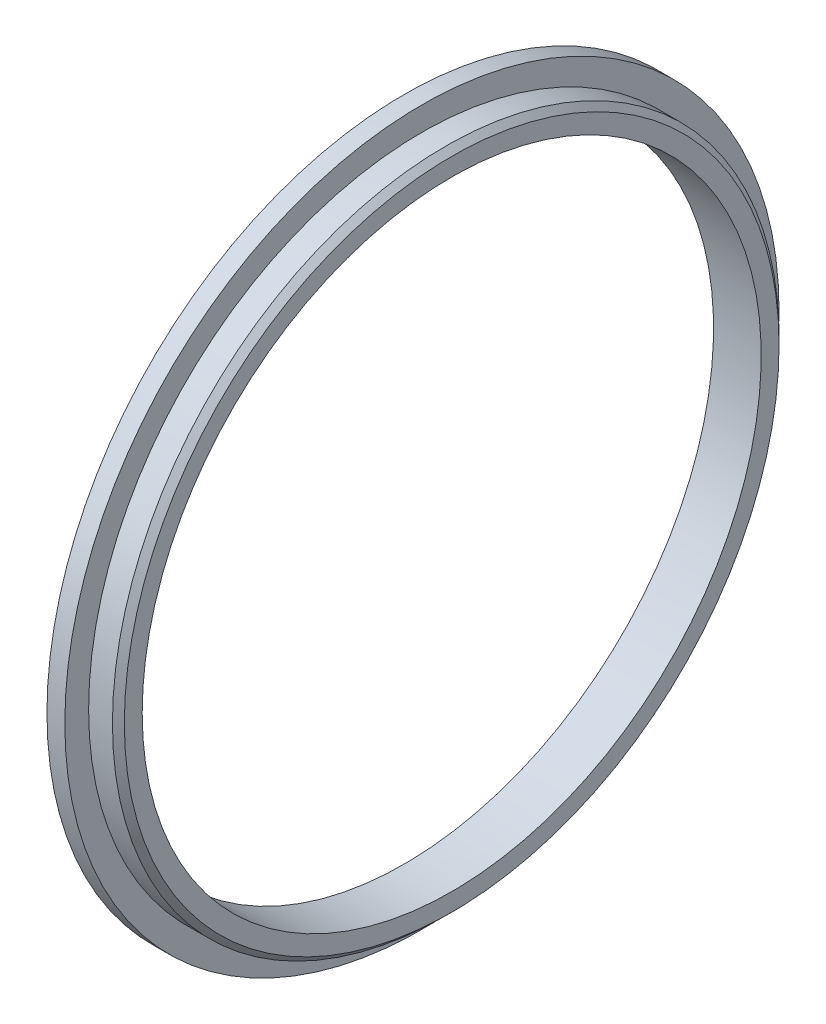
ISO-10303-21;
HEADER;
FILE_DESCRIPTION(('STEP AP214'),'2;1');
FILE_NAME('part.step','',(''),(''),'','','');
FILE_SCHEMA(('AUTOMOTIVE_DESIGN { 1 0 10303 214 1 1 1 1 }'));
ENDSEC;
DATA;
#1=APPLICATION_CONTEXT('core data for automotive mechanical design processes');
#2=APPLICATION_PROTOCOL_DEFINITION('international standard','automotive_design',2000,#1);
#3=PRODUCT_CONTEXT('',#1,'mechanical');
#4=PRODUCT('Part','Part','',(#3));
#5=PRODUCT_RELATED_PRODUCT_CATEGORY('part','',(#4));
#6=PRODUCT_DEFINITION_FORMATION('','',#4);
#7=PRODUCT_DEFINITION_CONTEXT('part definition',#1,'design');
#8=PRODUCT_DEFINITION('design','',#6,#7);
#9=PRODUCT_DEFINITION_SHAPE('','',#8);
#10=(LENGTH_UNIT() NAMED_UNIT(*) SI_UNIT(.MILLI.,.METRE.));
#11=(NAMED_UNIT(*) PLANE_ANGLE_UNIT() SI_UNIT($,.RADIAN.));
#12=(NAMED_UNIT(*) SI_UNIT($,.STERADIAN.) SOLID_ANGLE_UNIT());
#13=UNCERTAINTY_MEASURE_WITH_UNIT(LENGTH_MEASURE(1.E-05),#10,'distance_accuracy_value','');
#14=(GEOMETRIC_REPRESENTATION_CONTEXT(3) GLOBAL_UNCERTAINTY_ASSIGNED_CONTEXT((#13)) GLOBAL_UNIT_ASSIGNED_CONTEXT((#10,
#11,#12)) REPRESENTATION_CONTEXT('',''));
#15=CARTESIAN_POINT('',(0.,0.,0.));
#16=DIRECTION('',(0.,0.,1.));
#17=DIRECTION('',(1.,0.,0.));
#18=AXIS2_PLACEMENT_3D('',#15,#16,#17);
#19=CARTESIAN_POINT('',(-1.23336929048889,0.,0.));
#20=DIRECTION('',(-1.,0.,0.));
#21=DIRECTION('',(0.,0.,1.));
#22=AXIS2_PLACEMENT_3D('',#19,#20,#21);
#23=CYLINDRICAL_SURFACE('',#22,30.);
#24=CARTESIAN_POINT('',(0.,0.,0.));
#25=DIRECTION('',(-1.,0.,0.));
#26=DIRECTION('',(0.,0.,1.));
#27=AXIS2_PLACEMENT_3D('',#24,#25,#26);
#28=CIRCLE('',#27,30.);
#29=CARTESIAN_POINT('',(0.,0.,30.));
#30=VERTEX_POINT('',#29);
#31=EDGE_CURVE('E76',#30,#30,#28,.T.);
#32=ORIENTED_EDGE('',*,*,#31,.F.);
#33=EDGE_LOOP('',(#32));
#34=FACE_BOUND('',#33,.T.);
#35=CARTESIAN_POINT('',(1.5,0.,0.));
#36=DIRECTION('',(-1.,0.,0.));
#37=DIRECTION('',(0.,0.,1.));
#38=AXIS2_PLACEMENT_3D('',#35,#36,#37);
#39=CIRCLE('',#38,30.);
#40=CARTESIAN_POINT('',(1.5,0.,30.));
#41=VERTEX_POINT('',#40);
#42=EDGE_CURVE('E10',#41,#41,#39,.T.);
#43=ORIENTED_EDGE('',*,*,#42,.T.);
#44=EDGE_LOOP('',(#43));
#45=FACE_BOUND('',#44,.T.);
#46=ADVANCED_FACE('F45',(#34,#45),#23,.T.);
#47=CARTESIAN_POINT('',(1.5,30.,0.));
#48=DIRECTION('',(-1.,0.,0.));
#49=DIRECTION('',(0.,0.,1.));
#50=AXIS2_PLACEMENT_3D('',#47,#48,#49);
#51=PLANE('',#50);
#52=ORIENTED_EDGE('',*,*,#42,.F.);
#53=EDGE_LOOP('',(#52));
#54=FACE_BOUND('',#53,.T.);
#55=CARTESIAN_POINT('',(1.5,0.,0.));
#56=DIRECTION('',(-1.,0.,0.));
#57=DIRECTION('',(0.,0.,1.));
#58=AXIS2_PLACEMENT_3D('',#55,#56,#57);
#59=CIRCLE('',#58,28.);
#60=CARTESIAN_POINT('',(1.5,0.,28.));
#61=VERTEX_POINT('',#60);
#62=EDGE_CURVE('E52',#61,#61,#59,.T.);
#63=ORIENTED_EDGE('',*,*,#62,.T.);
#64=EDGE_LOOP('',(#63));
#65=FACE_BOUND('',#64,.T.);
#66=ADVANCED_FACE('F84',(#54,#65),#51,.F.);
#67=CARTESIAN_POINT('',(-1.23336929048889,0.,0.));
#68=DIRECTION('',(-1.,0.,0.));
#69=DIRECTION('',(0.,0.,1.));
#70=AXIS2_PLACEMENT_3D('',#67,#68,#69);
#71=CYLINDRICAL_SURFACE('',#70,28.);
#72=ORIENTED_EDGE('',*,*,#62,.F.);
#73=EDGE_LOOP('',(#72));
#74=FACE_BOUND('',#73,.T.);
#75=CARTESIAN_POINT('',(3.5,0.,0.));
#76=DIRECTION('',(-1.,0.,0.));
#77=DIRECTION('',(0.,0.,1.));
#78=AXIS2_PLACEMENT_3D('',#75,#76,#77);
#79=CIRCLE('',#78,28.);
#80=CARTESIAN_POINT('',(3.5,0.,28.));
#81=VERTEX_POINT('',#80);
#82=EDGE_CURVE('E57',#81,#81,#79,.T.);
#83=ORIENTED_EDGE('',*,*,#82,.T.);
#84=EDGE_LOOP('',(#83));
#85=FACE_BOUND('',#84,.T.);
#86=ADVANCED_FACE('F87',(#74,#85),#71,.T.);
#87=CARTESIAN_POINT('',(4.,0.,0.));
#88=DIRECTION('',(-1.,0.,0.));
#89=DIRECTION('',(0.,0.,1.));
#90=AXIS2_PLACEMENT_3D('',#87,#88,#89);
#91=CONICAL_SURFACE('',#90,27.5,0.785398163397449);
#92=ORIENTED_EDGE('',*,*,#82,.F.);
#93=EDGE_LOOP('',(#92));
#94=FACE_BOUND('',#93,.T.);
#95=CARTESIAN_POINT('',(4.,0.,0.));
#96=DIRECTION('',(-1.,0.,0.));
#97=DIRECTION('',(0.,0.,1.));
#98=AXIS2_PLACEMENT_3D('',#95,#96,#97);
#99=CIRCLE('',#98,27.5);
#100=CARTESIAN_POINT('',(4.,0.,27.5));
#101=VERTEX_POINT('',#100);
#102=EDGE_CURVE('E62',#101,#101,#99,.T.);
#103=ORIENTED_EDGE('',*,*,#102,.T.);
#104=EDGE_LOOP('',(#103));
#105=FACE_BOUND('',#104,.T.);
#106=ADVANCED_FACE('F91',(#94,#105),#91,.T.);
#107=CARTESIAN_POINT('',(4.,27.5,0.));
#108=DIRECTION('',(-1.,0.,0.));
#109=DIRECTION('',(0.,0.,1.));
#110=AXIS2_PLACEMENT_3D('',#107,#108,#109);
#111=PLANE('',#110);
#112=ORIENTED_EDGE('',*,*,#102,.F.);
#113=EDGE_LOOP('',(#112));
#114=FACE_BOUND('',#113,.T.);
#115=CARTESIAN_POINT('',(4.,0.,0.));
#116=DIRECTION('',(-1.,0.,0.));
#117=DIRECTION('',(0.,0.,1.));
#118=AXIS2_PLACEMENT_3D('',#115,#116,#117);
#119=CIRCLE('',#118,26.);
#120=CARTESIAN_POINT('',(4.,0.,26.));
#121=VERTEX_POINT('',#120);
#122=EDGE_CURVE('E68',#121,#121,#119,.T.);
#123=ORIENTED_EDGE('',*,*,#122,.T.);
#124=EDGE_LOOP('',(#123));
#125=FACE_BOUND('',#124,.T.);
#126=ADVANCED_FACE('F97',(#114,#125),#111,.F.);
#127=CARTESIAN_POINT('',(-1.23336929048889,0.,0.));
#128=DIRECTION('',(-1.,0.,0.));
#129=DIRECTION('',(0.,0.,1.));
#130=AXIS2_PLACEMENT_3D('',#127,#128,#129);
#131=CYLINDRICAL_SURFACE('',#130,26.);
#132=ORIENTED_EDGE('',*,*,#122,.F.);
#133=EDGE_LOOP('',(#132));
#134=FACE_BOUND('',#133,.T.);
#135=CARTESIAN_POINT('',(0.,0.,0.));
#136=DIRECTION('',(-1.,0.,0.));
#137=DIRECTION('',(0.,0.,1.));
#138=AXIS2_PLACEMENT_3D('',#135,#136,#137);
#139=CIRCLE('',#138,26.);
#140=CARTESIAN_POINT('',(0.,0.,26.));
#141=VERTEX_POINT('',#140);
#142=EDGE_CURVE('E72',#141,#141,#139,.T.);
#143=ORIENTED_EDGE('',*,*,#142,.T.);
#144=EDGE_LOOP('',(#143));
#145=FACE_BOUND('',#144,.T.);
#146=ADVANCED_FACE('F101',(#134,#145),#131,.F.);
#147=CARTESIAN_POINT('',(0.,26.,0.));
#148=DIRECTION('',(1.,0.,0.));
#149=DIRECTION('',(0.,0.,-1.));
#150=AXIS2_PLACEMENT_3D('',#147,#148,#149);
#151=PLANE('',#150);
#152=ORIENTED_EDGE('',*,*,#142,.F.);
#153=EDGE_LOOP('',(#152));
#154=FACE_BOUND('',#153,.T.);
#155=ORIENTED_EDGE('',*,*,#31,.T.);
#156=EDGE_LOOP('',(#155));
#157=FACE_BOUND('',#156,.T.);
#158=ADVANCED_FACE('F81',(#154,#157),#151,.F.);
#159=CLOSED_SHELL('',(#46,#66,#86,#106,#126,#146,#158));
#160=MANIFOLD_SOLID_BREP('B2',#159);
#161=ADVANCED_BREP_SHAPE_REPRESENTATION('',(#18,#160),#14);
#162=SHAPE_DEFINITION_REPRESENTATION(#9,#161);
ENDSEC;
END-ISO-10303-21;
